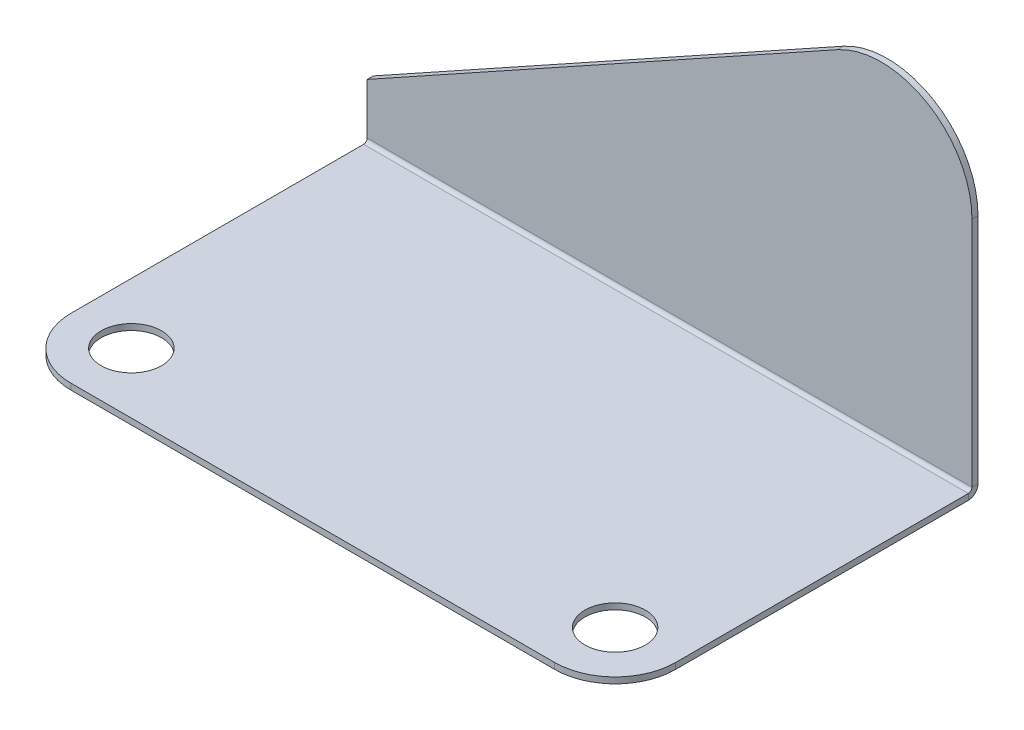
ISO-10303-21;
HEADER;
FILE_DESCRIPTION(('STEP AP214'),'2;1');
FILE_NAME('part.step','',(''),(''),'','','');
FILE_SCHEMA(('AUTOMOTIVE_DESIGN { 1 0 10303 214 1 1 1 1 }'));
ENDSEC;
DATA;
#1=APPLICATION_CONTEXT('core data for automotive mechanical design processes');
#2=APPLICATION_PROTOCOL_DEFINITION('international standard','automotive_design',2000,#1);
#3=PRODUCT_CONTEXT('',#1,'mechanical');
#4=PRODUCT('Part','Part','',(#3));
#5=PRODUCT_RELATED_PRODUCT_CATEGORY('part','',(#4));
#6=PRODUCT_DEFINITION_FORMATION('','',#4);
#7=PRODUCT_DEFINITION_CONTEXT('part definition',#1,'design');
#8=PRODUCT_DEFINITION('design','',#6,#7);
#9=PRODUCT_DEFINITION_SHAPE('','',#8);
#10=(LENGTH_UNIT() NAMED_UNIT(*) SI_UNIT(.MILLI.,.METRE.));
#11=(NAMED_UNIT(*) PLANE_ANGLE_UNIT() SI_UNIT($,.RADIAN.));
#12=(NAMED_UNIT(*) SI_UNIT($,.STERADIAN.) SOLID_ANGLE_UNIT());
#13=UNCERTAINTY_MEASURE_WITH_UNIT(LENGTH_MEASURE(1.E-05),#10,'distance_accuracy_value','');
#14=(GEOMETRIC_REPRESENTATION_CONTEXT(3) GLOBAL_UNCERTAINTY_ASSIGNED_CONTEXT((#13)) GLOBAL_UNIT_ASSIGNED_CONTEXT((#10,
#11,#12)) REPRESENTATION_CONTEXT('',''));
#15=CARTESIAN_POINT('',(0.,0.,0.));
#16=DIRECTION('',(0.,0.,1.));
#17=DIRECTION('',(1.,0.,0.));
#18=AXIS2_PLACEMENT_3D('',#15,#16,#17);
#19=CARTESIAN_POINT('',(-127.,12.7,0.));
#20=DIRECTION('',(-1.,0.,0.));
#21=DIRECTION('',(0.,-1.,0.));
#22=AXIS2_PLACEMENT_3D('',#19,#20,#21);
#23=PLANE('',#22);
#24=DIRECTION('',(0.,0.,-1.));
#25=VECTOR('',#24,1.);
#26=CARTESIAN_POINT('',(-127.,2.032,0.));
#27=LINE('',#26,#25);
#28=CARTESIAN_POINT('',(-127.,2.032,1.27000000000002));
#29=VERTEX_POINT('',#28);
#30=CARTESIAN_POINT('',(-127.,2.032,0.));
#31=VERTEX_POINT('',#30);
#32=EDGE_CURVE('E11',#29,#31,#27,.T.);
#33=ORIENTED_EDGE('',*,*,#32,.F.);
#34=DIRECTION('',(0.,1.,0.));
#35=VECTOR('',#34,1.);
#36=CARTESIAN_POINT('',(-127.,12.7,1.27000000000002));
#37=LINE('',#36,#35);
#38=CARTESIAN_POINT('',(-127.,12.7,1.27000000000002));
#39=VERTEX_POINT('',#38);
#40=EDGE_CURVE('E93',#39,#29,#37,.F.);
#41=ORIENTED_EDGE('',*,*,#40,.F.);
#42=DIRECTION('',(0.,0.,-1.));
#43=VECTOR('',#42,1.);
#44=CARTESIAN_POINT('',(-127.,12.7,0.));
#45=LINE('',#44,#43);
#46=CARTESIAN_POINT('',(-127.,12.7,0.));
#47=VERTEX_POINT('',#46);
#48=EDGE_CURVE('E44',#39,#47,#45,.T.);
#49=ORIENTED_EDGE('',*,*,#48,.T.);
#50=DIRECTION('',(0.,-1.,0.));
#51=VECTOR('',#50,1.);
#52=CARTESIAN_POINT('',(-127.,12.7,0.));
#53=LINE('',#52,#51);
#54=EDGE_CURVE('E96',#47,#31,#53,.T.);
#55=ORIENTED_EDGE('',*,*,#54,.T.);
#56=EDGE_LOOP('',(#33,#41,#49,#55));
#57=FACE_BOUND('',#56,.T.);
#58=ADVANCED_FACE('F34',(#57),#23,.T.);
#59=CARTESIAN_POINT('',(-28.2912038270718,67.4584108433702,0.));
#60=DIRECTION('',(0.485102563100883,-0.874457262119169,0.));
#61=DIRECTION('',(0.874457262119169,0.485102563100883,0.));
#62=AXIS2_PLACEMENT_3D('',#59,#60,#61);
#63=PLANE('',#62);
#64=ORIENTED_EDGE('',*,*,#48,.F.);
#65=DIRECTION('',(0.874457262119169,0.485102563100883,0.));
#66=VECTOR('',#65,1.);
#67=CARTESIAN_POINT('',(-28.2912038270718,67.4584108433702,1.27));
#68=LINE('',#67,#66);
#69=CARTESIAN_POINT('',(-28.2912038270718,67.4584108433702,1.27));
#70=VERTEX_POINT('',#69);
#71=EDGE_CURVE('E122',#39,#70,#68,.T.);
#72=ORIENTED_EDGE('',*,*,#71,.T.);
#73=DIRECTION('',(0.,0.,-1.));
#74=VECTOR('',#73,1.);
#75=CARTESIAN_POINT('',(-28.2912038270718,67.4584108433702,0.));
#76=LINE('',#75,#74);
#77=CARTESIAN_POINT('',(-28.2912038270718,67.4584108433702,0.));
#78=VERTEX_POINT('',#77);
#79=EDGE_CURVE('E149',#70,#78,#76,.T.);
#80=ORIENTED_EDGE('',*,*,#79,.T.);
#81=DIRECTION('',(0.874457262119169,0.485102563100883,0.));
#82=VECTOR('',#81,1.);
#83=CARTESIAN_POINT('',(-28.2912038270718,67.4584108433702,0.));
#84=LINE('',#83,#82);
#85=EDGE_CURVE('E161',#47,#78,#84,.T.);
#86=ORIENTED_EDGE('',*,*,#85,.F.);
#87=EDGE_LOOP('',(#64,#72,#80,#86));
#88=FACE_BOUND('',#87,.T.);
#89=ADVANCED_FACE('F167',(#88),#63,.F.);
#90=CARTESIAN_POINT('',(-19.05,50.8,0.));
#91=DIRECTION('',(0.,0.,-1.));
#92=DIRECTION('',(-1.,0.,0.));
#93=AXIS2_PLACEMENT_3D('',#90,#91,#92);
#94=CYLINDRICAL_SURFACE('',#93,19.05);
#95=ORIENTED_EDGE('',*,*,#79,.F.);
#96=CARTESIAN_POINT('',(-19.05,50.8,1.27));
#97=DIRECTION('',(0.,0.,-1.));
#98=DIRECTION('',(-1.,0.,0.));
#99=AXIS2_PLACEMENT_3D('',#96,#97,#98);
#100=CIRCLE('',#99,19.05);
#101=CARTESIAN_POINT('',(0.,50.8,1.27));
#102=VERTEX_POINT('',#101);
#103=EDGE_CURVE('E225',#70,#102,#100,.T.);
#104=ORIENTED_EDGE('',*,*,#103,.T.);
#105=DIRECTION('',(0.,0.,-1.));
#106=VECTOR('',#105,1.);
#107=CARTESIAN_POINT('',(0.,50.8,0.));
#108=LINE('',#107,#106);
#109=CARTESIAN_POINT('',(0.,50.8,0.));
#110=VERTEX_POINT('',#109);
#111=EDGE_CURVE('E146',#102,#110,#108,.T.);
#112=ORIENTED_EDGE('',*,*,#111,.T.);
#113=CARTESIAN_POINT('',(-19.05,50.8,0.));
#114=DIRECTION('',(0.,0.,-1.));
#115=DIRECTION('',(1.,0.,0.));
#116=AXIS2_PLACEMENT_3D('',#113,#114,#115);
#117=CIRCLE('',#116,19.05);
#118=EDGE_CURVE('E168',#78,#110,#117,.T.);
#119=ORIENTED_EDGE('',*,*,#118,.F.);
#120=EDGE_LOOP('',(#95,#104,#112,#119));
#121=FACE_BOUND('',#120,.T.);
#122=ADVANCED_FACE('F228',(#121),#94,.T.);
#123=CARTESIAN_POINT('',(0.,12.7,0.));
#124=DIRECTION('',(-1.,0.,0.));
#125=DIRECTION('',(0.,-1.,0.));
#126=AXIS2_PLACEMENT_3D('',#123,#124,#125);
#127=PLANE('',#126);
#128=ORIENTED_EDGE('',*,*,#111,.F.);
#129=DIRECTION('',(0.,1.,0.));
#130=VECTOR('',#129,1.);
#131=CARTESIAN_POINT('',(0.,12.7,1.27));
#132=LINE('',#131,#130);
#133=CARTESIAN_POINT('',(0.,2.032,1.27));
#134=VERTEX_POINT('',#133);
#135=EDGE_CURVE('E207',#102,#134,#132,.F.);
#136=ORIENTED_EDGE('',*,*,#135,.T.);
#137=DIRECTION('',(0.,0.,-1.));
#138=VECTOR('',#137,1.);
#139=CARTESIAN_POINT('',(0.,2.032,0.));
#140=LINE('',#139,#138);
#141=CARTESIAN_POINT('',(0.,2.032,0.));
#142=VERTEX_POINT('',#141);
#143=EDGE_CURVE('E143',#134,#142,#140,.T.);
#144=ORIENTED_EDGE('',*,*,#143,.T.);
#145=DIRECTION('',(0.,-1.,0.));
#146=VECTOR('',#145,1.);
#147=CARTESIAN_POINT('',(0.,12.7,0.));
#148=LINE('',#147,#146);
#149=EDGE_CURVE('E170',#110,#142,#148,.T.);
#150=ORIENTED_EDGE('',*,*,#149,.F.);
#151=EDGE_LOOP('',(#128,#136,#144,#150));
#152=FACE_BOUND('',#151,.T.);
#153=ADVANCED_FACE('F231',(#152),#127,.F.);
#154=CARTESIAN_POINT('',(0.,2.032,2.032));
#155=DIRECTION('',(1.,0.,0.));
#156=DIRECTION('',(0.,0.,-1.));
#157=AXIS2_PLACEMENT_3D('',#154,#155,#156);
#158=PLANE('',#157);
#159=ORIENTED_EDGE('',*,*,#143,.F.);
#160=CARTESIAN_POINT('',(0.,2.032,2.032));
#161=DIRECTION('',(1.,0.,0.));
#162=DIRECTION('',(0.,0.,-1.));
#163=AXIS2_PLACEMENT_3D('',#160,#161,#162);
#164=CIRCLE('',#163,0.762);
#165=CARTESIAN_POINT('',(0.,1.27,2.032));
#166=VERTEX_POINT('',#165);
#167=EDGE_CURVE('E111',#134,#166,#164,.F.);
#168=ORIENTED_EDGE('',*,*,#167,.T.);
#169=DIRECTION('',(0.,-1.,0.));
#170=VECTOR('',#169,1.);
#171=CARTESIAN_POINT('',(0.,0.,2.032));
#172=LINE('',#171,#170);
#173=CARTESIAN_POINT('',(0.,0.,2.032));
#174=VERTEX_POINT('',#173);
#175=EDGE_CURVE('E52',#166,#174,#172,.T.);
#176=ORIENTED_EDGE('',*,*,#175,.T.);
#177=CARTESIAN_POINT('',(0.,2.032,2.032));
#178=DIRECTION('',(-1.,0.,0.));
#179=DIRECTION('',(0.,0.,1.));
#180=AXIS2_PLACEMENT_3D('',#177,#178,#179);
#181=CIRCLE('',#180,2.032);
#182=EDGE_CURVE('E165',#142,#174,#181,.T.);
#183=ORIENTED_EDGE('',*,*,#182,.F.);
#184=EDGE_LOOP('',(#159,#168,#176,#183));
#185=FACE_BOUND('',#184,.T.);
#186=ADVANCED_FACE('F235',(#185),#158,.T.);
#187=CARTESIAN_POINT('',(0.,0.,0.));
#188=DIRECTION('',(-1.,0.,0.));
#189=DIRECTION('',(0.,0.,-1.));
#190=AXIS2_PLACEMENT_3D('',#187,#188,#189);
#191=PLANE('',#190);
#192=ORIENTED_EDGE('',*,*,#175,.F.);
#193=DIRECTION('',(0.,0.,-1.));
#194=VECTOR('',#193,1.);
#195=CARTESIAN_POINT('',(0.,1.27,0.));
#196=LINE('',#195,#194);
#197=CARTESIAN_POINT('',(0.,1.27,63.5));
#198=VERTEX_POINT('',#197);
#199=EDGE_CURVE('E214',#198,#166,#196,.T.);
#200=ORIENTED_EDGE('',*,*,#199,.F.);
#201=DIRECTION('',(0.,-1.,0.));
#202=VECTOR('',#201,1.);
#203=CARTESIAN_POINT('',(0.,0.,63.5));
#204=LINE('',#203,#202);
#205=CARTESIAN_POINT('',(0.,0.,63.5));
#206=VERTEX_POINT('',#205);
#207=EDGE_CURVE('E139',#198,#206,#204,.T.);
#208=ORIENTED_EDGE('',*,*,#207,.T.);
#209=DIRECTION('',(0.,0.,-1.));
#210=VECTOR('',#209,1.);
#211=CARTESIAN_POINT('',(0.,0.,0.));
#212=LINE('',#211,#210);
#213=EDGE_CURVE('E189',#206,#174,#212,.T.);
#214=ORIENTED_EDGE('',*,*,#213,.T.);
#215=EDGE_LOOP('',(#192,#200,#208,#214));
#216=FACE_BOUND('',#215,.T.);
#217=ADVANCED_FACE('F268',(#216),#191,.F.);
#218=CARTESIAN_POINT('',(-12.7,0.,63.5));
#219=DIRECTION('',(0.,-1.,0.));
#220=DIRECTION('',(0.,0.,-1.));
#221=AXIS2_PLACEMENT_3D('',#218,#219,#220);
#222=CYLINDRICAL_SURFACE('',#221,12.7);
#223=ORIENTED_EDGE('',*,*,#207,.F.);
#224=CARTESIAN_POINT('',(-12.7,1.27,63.5));
#225=DIRECTION('',(0.,-1.,0.));
#226=DIRECTION('',(0.,0.,-1.));
#227=AXIS2_PLACEMENT_3D('',#224,#225,#226);
#228=CIRCLE('',#227,12.7);
#229=CARTESIAN_POINT('',(-12.7,1.27,76.2));
#230=VERTEX_POINT('',#229);
#231=EDGE_CURVE('E116',#198,#230,#228,.T.);
#232=ORIENTED_EDGE('',*,*,#231,.T.);
#233=DIRECTION('',(0.,-1.,0.));
#234=VECTOR('',#233,1.);
#235=CARTESIAN_POINT('',(-12.7,0.,76.2));
#236=LINE('',#235,#234);
#237=CARTESIAN_POINT('',(-12.7,0.,76.2));
#238=VERTEX_POINT('',#237);
#239=EDGE_CURVE('E136',#230,#238,#236,.T.);
#240=ORIENTED_EDGE('',*,*,#239,.T.);
#241=CARTESIAN_POINT('',(-12.7,0.,63.5));
#242=DIRECTION('',(0.,-1.,0.));
#243=DIRECTION('',(0.,0.,-1.));
#244=AXIS2_PLACEMENT_3D('',#241,#242,#243);
#245=CIRCLE('',#244,12.7);
#246=EDGE_CURVE('E192',#206,#238,#245,.T.);
#247=ORIENTED_EDGE('',*,*,#246,.F.);
#248=EDGE_LOOP('',(#223,#232,#240,#247));
#249=FACE_BOUND('',#248,.T.);
#250=ADVANCED_FACE('F270',(#249),#222,.T.);
#251=CARTESIAN_POINT('',(0.,0.,76.2));
#252=DIRECTION('',(0.,0.,-1.));
#253=DIRECTION('',(1.,0.,0.));
#254=AXIS2_PLACEMENT_3D('',#251,#252,#253);
#255=PLANE('',#254);
#256=ORIENTED_EDGE('',*,*,#239,.F.);
#257=DIRECTION('',(1.,0.,0.));
#258=VECTOR('',#257,1.);
#259=CARTESIAN_POINT('',(0.,1.27,76.2));
#260=LINE('',#259,#258);
#261=CARTESIAN_POINT('',(-114.3,1.27,76.2));
#262=VERTEX_POINT('',#261);
#263=EDGE_CURVE('E210',#262,#230,#260,.T.);
#264=ORIENTED_EDGE('',*,*,#263,.F.);
#265=DIRECTION('',(0.,-1.,0.));
#266=VECTOR('',#265,1.);
#267=CARTESIAN_POINT('',(-114.3,0.,76.2));
#268=LINE('',#267,#266);
#269=CARTESIAN_POINT('',(-114.3,0.,76.2));
#270=VERTEX_POINT('',#269);
#271=EDGE_CURVE('E133',#262,#270,#268,.T.);
#272=ORIENTED_EDGE('',*,*,#271,.T.);
#273=DIRECTION('',(1.,0.,0.));
#274=VECTOR('',#273,1.);
#275=CARTESIAN_POINT('',(0.,0.,76.2));
#276=LINE('',#275,#274);
#277=EDGE_CURVE('E180',#270,#238,#276,.T.);
#278=ORIENTED_EDGE('',*,*,#277,.T.);
#279=EDGE_LOOP('',(#256,#264,#272,#278));
#280=FACE_BOUND('',#279,.T.);
#281=ADVANCED_FACE('F251',(#280),#255,.F.);
#282=CARTESIAN_POINT('',(-114.3,0.,63.5));
#283=DIRECTION('',(0.,-1.,0.));
#284=DIRECTION('',(0.,0.,-1.));
#285=AXIS2_PLACEMENT_3D('',#282,#283,#284);
#286=CYLINDRICAL_SURFACE('',#285,12.7);
#287=ORIENTED_EDGE('',*,*,#271,.F.);
#288=CARTESIAN_POINT('',(-114.3,1.27,63.5));
#289=DIRECTION('',(0.,-1.,0.));
#290=DIRECTION('',(0.,0.,-1.));
#291=AXIS2_PLACEMENT_3D('',#288,#289,#290);
#292=CIRCLE('',#291,12.7);
#293=CARTESIAN_POINT('',(-127.,1.27,63.5));
#294=VERTEX_POINT('',#293);
#295=EDGE_CURVE('E215',#262,#294,#292,.T.);
#296=ORIENTED_EDGE('',*,*,#295,.T.);
#297=DIRECTION('',(0.,-1.,0.));
#298=VECTOR('',#297,1.);
#299=CARTESIAN_POINT('',(-127.,0.,63.5));
#300=LINE('',#299,#298);
#301=CARTESIAN_POINT('',(-127.,0.,63.5));
#302=VERTEX_POINT('',#301);
#303=EDGE_CURVE('E130',#294,#302,#300,.T.);
#304=ORIENTED_EDGE('',*,*,#303,.T.);
#305=CARTESIAN_POINT('',(-114.3,0.,63.5));
#306=DIRECTION('',(0.,-1.,0.));
#307=DIRECTION('',(0.,0.,-1.));
#308=AXIS2_PLACEMENT_3D('',#305,#306,#307);
#309=CIRCLE('',#308,12.7);
#310=EDGE_CURVE('E183',#270,#302,#309,.T.);
#311=ORIENTED_EDGE('',*,*,#310,.F.);
#312=EDGE_LOOP('',(#287,#296,#304,#311));
#313=FACE_BOUND('',#312,.T.);
#314=ADVANCED_FACE('F260',(#313),#286,.T.);
#315=CARTESIAN_POINT('',(-127.,0.,0.));
#316=DIRECTION('',(1.,0.,0.));
#317=DIRECTION('',(0.,0.,1.));
#318=AXIS2_PLACEMENT_3D('',#315,#316,#317);
#319=PLANE('',#318);
#320=ORIENTED_EDGE('',*,*,#303,.F.);
#321=DIRECTION('',(0.,0.,-1.));
#322=VECTOR('',#321,1.);
#323=CARTESIAN_POINT('',(-127.,1.27,0.));
#324=LINE('',#323,#322);
#325=CARTESIAN_POINT('',(-127.,1.27,2.03200000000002));
#326=VERTEX_POINT('',#325);
#327=EDGE_CURVE('E211',#326,#294,#324,.F.);
#328=ORIENTED_EDGE('',*,*,#327,.F.);
#329=DIRECTION('',(0.,-1.,0.));
#330=VECTOR('',#329,1.);
#331=CARTESIAN_POINT('',(-127.,0.,2.03200000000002));
#332=LINE('',#331,#330);
#333=CARTESIAN_POINT('',(-127.,0.,2.03200000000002));
#334=VERTEX_POINT('',#333);
#335=EDGE_CURVE('E38',#326,#334,#332,.T.);
#336=ORIENTED_EDGE('',*,*,#335,.T.);
#337=DIRECTION('',(0.,0.,1.));
#338=VECTOR('',#337,1.);
#339=CARTESIAN_POINT('',(-127.,0.,0.));
#340=LINE('',#339,#338);
#341=EDGE_CURVE('E186',#334,#302,#340,.T.);
#342=ORIENTED_EDGE('',*,*,#341,.T.);
#343=EDGE_LOOP('',(#320,#328,#336,#342));
#344=FACE_BOUND('',#343,.T.);
#345=ADVANCED_FACE('F262',(#344),#319,.F.);
#346=CARTESIAN_POINT('',(-114.3,0.,63.5));
#347=DIRECTION('',(0.,1.,0.));
#348=DIRECTION('',(0.,0.,1.));
#349=AXIS2_PLACEMENT_3D('',#346,#347,#348);
#350=CYLINDRICAL_SURFACE('',#349,6.34999999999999);
#351=CARTESIAN_POINT('',(-114.3,0.,63.5));
#352=DIRECTION('',(0.,1.,0.));
#353=DIRECTION('',(0.,0.,-1.));
#354=AXIS2_PLACEMENT_3D('',#351,#352,#353);
#355=CIRCLE('',#354,6.34999999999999);
#356=CARTESIAN_POINT('',(-114.3,0.,57.15));
#357=VERTEX_POINT('',#356);
#358=EDGE_CURVE('E174',#357,#357,#355,.T.);
#359=ORIENTED_EDGE('',*,*,#358,.F.);
#360=EDGE_LOOP('',(#359));
#361=FACE_BOUND('',#360,.T.);
#362=CARTESIAN_POINT('',(-114.3,1.27,63.5));
#363=DIRECTION('',(0.,1.,0.));
#364=DIRECTION('',(0.,0.,1.));
#365=AXIS2_PLACEMENT_3D('',#362,#363,#364);
#366=CIRCLE('',#365,6.34999999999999);
#367=CARTESIAN_POINT('',(-114.3,1.27,69.85));
#368=VERTEX_POINT('',#367);
#369=EDGE_CURVE('E203',#368,#368,#366,.T.);
#370=ORIENTED_EDGE('',*,*,#369,.T.);
#371=EDGE_LOOP('',(#370));
#372=FACE_BOUND('',#371,.T.);
#373=ADVANCED_FACE('F329',(#361,#372),#350,.F.);
#374=CARTESIAN_POINT('',(-12.7,0.,63.5));
#375=DIRECTION('',(0.,1.,0.));
#376=DIRECTION('',(0.,0.,1.));
#377=AXIS2_PLACEMENT_3D('',#374,#375,#376);
#378=CYLINDRICAL_SURFACE('',#377,6.35);
#379=CARTESIAN_POINT('',(-12.7,0.,63.5));
#380=DIRECTION('',(0.,1.,0.));
#381=DIRECTION('',(0.,0.,1.));
#382=AXIS2_PLACEMENT_3D('',#379,#380,#381);
#383=CIRCLE('',#382,6.35);
#384=CARTESIAN_POINT('',(-12.7,0.,69.85));
#385=VERTEX_POINT('',#384);
#386=EDGE_CURVE('E177',#385,#385,#383,.T.);
#387=ORIENTED_EDGE('',*,*,#386,.F.);
#388=EDGE_LOOP('',(#387));
#389=FACE_BOUND('',#388,.T.);
#390=CARTESIAN_POINT('',(-12.7,1.27,63.5));
#391=DIRECTION('',(0.,1.,0.));
#392=DIRECTION('',(0.,0.,1.));
#393=AXIS2_PLACEMENT_3D('',#390,#391,#392);
#394=CIRCLE('',#393,6.35);
#395=CARTESIAN_POINT('',(-12.7,1.27,69.85));
#396=VERTEX_POINT('',#395);
#397=EDGE_CURVE('E206',#396,#396,#394,.T.);
#398=ORIENTED_EDGE('',*,*,#397,.T.);
#399=EDGE_LOOP('',(#398));
#400=FACE_BOUND('',#399,.T.);
#401=ADVANCED_FACE('F339',(#389,#400),#378,.F.);
#402=CARTESIAN_POINT('',(-127.,2.032,2.03200000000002));
#403=DIRECTION('',(1.,0.,0.));
#404=DIRECTION('',(0.,0.,-1.));
#405=AXIS2_PLACEMENT_3D('',#402,#403,#404);
#406=PLANE('',#405);
#407=CARTESIAN_POINT('',(-127.,2.032,2.03200000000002));
#408=DIRECTION('',(1.,0.,0.));
#409=DIRECTION('',(0.,0.,-1.));
#410=AXIS2_PLACEMENT_3D('',#407,#408,#409);
#411=CIRCLE('',#410,0.762);
#412=EDGE_CURVE('E109',#326,#29,#411,.T.);
#413=ORIENTED_EDGE('',*,*,#412,.T.);
#414=ORIENTED_EDGE('',*,*,#32,.T.);
#415=CARTESIAN_POINT('',(-127.,2.032,2.03200000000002));
#416=DIRECTION('',(-1.,0.,0.));
#417=DIRECTION('',(0.,0.,1.));
#418=AXIS2_PLACEMENT_3D('',#415,#416,#417);
#419=CIRCLE('',#418,2.032);
#420=EDGE_CURVE('E199',#334,#31,#419,.F.);
#421=ORIENTED_EDGE('',*,*,#420,.F.);
#422=ORIENTED_EDGE('',*,*,#335,.F.);
#423=EDGE_LOOP('',(#413,#414,#421,#422));
#424=FACE_BOUND('',#423,.T.);
#425=ADVANCED_FACE('F36',(#424),#406,.F.);
#426=CARTESIAN_POINT('',(0.,0.,0.));
#427=DIRECTION('',(0.,-1.,0.));
#428=DIRECTION('',(0.,0.,-1.));
#429=AXIS2_PLACEMENT_3D('',#426,#427,#428);
#430=PLANE('',#429);
#431=ORIENTED_EDGE('',*,*,#358,.T.);
#432=EDGE_LOOP('',(#431));
#433=FACE_BOUND('',#432,.T.);
#434=ORIENTED_EDGE('',*,*,#386,.T.);
#435=EDGE_LOOP('',(#434));
#436=FACE_BOUND('',#435,.T.);
#437=ORIENTED_EDGE('',*,*,#341,.F.);
#438=DIRECTION('',(-1.,0.,0.));
#439=VECTOR('',#438,1.);
#440=CARTESIAN_POINT('',(0.,0.,2.032));
#441=LINE('',#440,#439);
#442=EDGE_CURVE('E196',#334,#174,#441,.F.);
#443=ORIENTED_EDGE('',*,*,#442,.T.);
#444=ORIENTED_EDGE('',*,*,#213,.F.);
#445=ORIENTED_EDGE('',*,*,#246,.T.);
#446=ORIENTED_EDGE('',*,*,#277,.F.);
#447=ORIENTED_EDGE('',*,*,#310,.T.);
#448=EDGE_LOOP('',(#437,#443,#444,#445,#446,#447));
#449=FACE_BOUND('',#448,.T.);
#450=ADVANCED_FACE('F257',(#433,#436,#449),#430,.T.);
#451=CARTESIAN_POINT('',(0.,12.7,0.));
#452=DIRECTION('',(0.,0.,1.));
#453=DIRECTION('',(1.,0.,0.));
#454=AXIS2_PLACEMENT_3D('',#451,#452,#453);
#455=PLANE('',#454);
#456=ORIENTED_EDGE('',*,*,#149,.T.);
#457=DIRECTION('',(-1.,0.,0.));
#458=VECTOR('',#457,1.);
#459=CARTESIAN_POINT('',(-127.,2.032,0.));
#460=LINE('',#459,#458);
#461=EDGE_CURVE('E164',#142,#31,#460,.T.);
#462=ORIENTED_EDGE('',*,*,#461,.T.);
#463=ORIENTED_EDGE('',*,*,#54,.F.);
#464=ORIENTED_EDGE('',*,*,#85,.T.);
#465=ORIENTED_EDGE('',*,*,#118,.T.);
#466=EDGE_LOOP('',(#456,#462,#463,#464,#465));
#467=FACE_BOUND('',#466,.T.);
#468=ADVANCED_FACE('F159',(#467),#455,.F.);
#469=CARTESIAN_POINT('',(0.,2.032,2.032));
#470=DIRECTION('',(1.,0.,0.));
#471=DIRECTION('',(0.,0.,-1.));
#472=AXIS2_PLACEMENT_3D('',#469,#470,#471);
#473=CYLINDRICAL_SURFACE('',#472,2.032);
#474=ORIENTED_EDGE('',*,*,#182,.T.);
#475=ORIENTED_EDGE('',*,*,#442,.F.);
#476=ORIENTED_EDGE('',*,*,#420,.T.);
#477=ORIENTED_EDGE('',*,*,#461,.F.);
#478=EDGE_LOOP('',(#474,#475,#476,#477));
#479=FACE_BOUND('',#478,.T.);
#480=ADVANCED_FACE('F238',(#479),#473,.T.);
#481=CARTESIAN_POINT('',(0.,1.27,0.));
#482=DIRECTION('',(0.,-1.,0.));
#483=DIRECTION('',(0.,0.,-1.));
#484=AXIS2_PLACEMENT_3D('',#481,#482,#483);
#485=PLANE('',#484);
#486=ORIENTED_EDGE('',*,*,#369,.F.);
#487=EDGE_LOOP('',(#486));
#488=FACE_BOUND('',#487,.T.);
#489=ORIENTED_EDGE('',*,*,#397,.F.);
#490=EDGE_LOOP('',(#489));
#491=FACE_BOUND('',#490,.T.);
#492=ORIENTED_EDGE('',*,*,#327,.T.);
#493=ORIENTED_EDGE('',*,*,#295,.F.);
#494=ORIENTED_EDGE('',*,*,#263,.T.);
#495=ORIENTED_EDGE('',*,*,#231,.F.);
#496=ORIENTED_EDGE('',*,*,#199,.T.);
#497=DIRECTION('',(1.,0.,0.));
#498=VECTOR('',#497,1.);
#499=CARTESIAN_POINT('',(0.,1.27,2.03200000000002));
#500=LINE('',#499,#498);
#501=EDGE_CURVE('E115',#326,#166,#500,.T.);
#502=ORIENTED_EDGE('',*,*,#501,.F.);
#503=EDGE_LOOP('',(#492,#493,#494,#495,#496,#502));
#504=FACE_BOUND('',#503,.T.);
#505=ADVANCED_FACE('F264',(#488,#491,#504),#485,.F.);
#506=CARTESIAN_POINT('',(0.,12.7,1.27));
#507=DIRECTION('',(0.,0.,1.));
#508=DIRECTION('',(1.,0.,0.));
#509=AXIS2_PLACEMENT_3D('',#506,#507,#508);
#510=PLANE('',#509);
#511=ORIENTED_EDGE('',*,*,#135,.F.);
#512=ORIENTED_EDGE('',*,*,#103,.F.);
#513=ORIENTED_EDGE('',*,*,#71,.F.);
#514=ORIENTED_EDGE('',*,*,#40,.T.);
#515=DIRECTION('',(1.,0.,0.));
#516=VECTOR('',#515,1.);
#517=CARTESIAN_POINT('',(0.,2.032,1.27));
#518=LINE('',#517,#516);
#519=EDGE_CURVE('E106',#134,#29,#518,.F.);
#520=ORIENTED_EDGE('',*,*,#519,.F.);
#521=EDGE_LOOP('',(#511,#512,#513,#514,#520));
#522=FACE_BOUND('',#521,.T.);
#523=ADVANCED_FACE('F119',(#522),#510,.T.);
#524=CARTESIAN_POINT('',(0.,2.032,2.032));
#525=DIRECTION('',(1.,0.,0.));
#526=DIRECTION('',(0.,0.,-1.));
#527=AXIS2_PLACEMENT_3D('',#524,#525,#526);
#528=CYLINDRICAL_SURFACE('',#527,0.762);
#529=ORIENTED_EDGE('',*,*,#167,.F.);
#530=ORIENTED_EDGE('',*,*,#519,.T.);
#531=ORIENTED_EDGE('',*,*,#412,.F.);
#532=ORIENTED_EDGE('',*,*,#501,.T.);
#533=EDGE_LOOP('',(#529,#530,#531,#532));
#534=FACE_BOUND('',#533,.T.);
#535=ADVANCED_FACE('F107',(#534),#528,.F.);
#536=CLOSED_SHELL('',(#58,#89,#122,#153,#186,#217,#250,#281,#314,#345,#373,#401,#425,#450,#468,
#480,#505,#523,#535));
#537=MANIFOLD_SOLID_BREP('B2',#536);
#538=ADVANCED_BREP_SHAPE_REPRESENTATION('',(#18,#537),#14);
#539=SHAPE_DEFINITION_REPRESENTATION(#9,#538);
ENDSEC;
END-ISO-10303-21;
